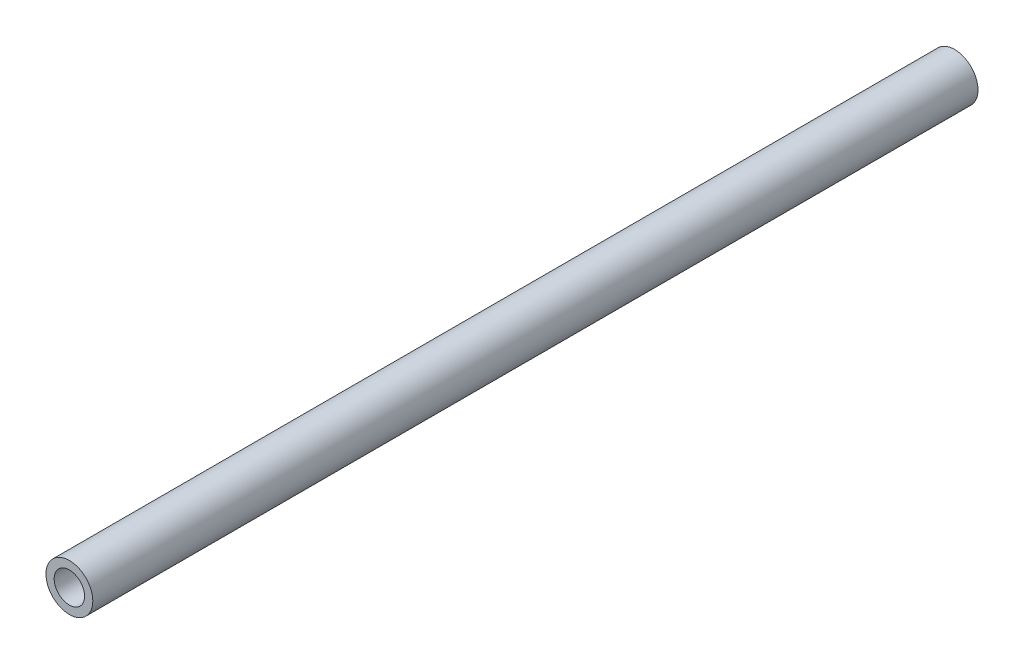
from build123d import *

# Parameters (mm, degrees)
SKETCH_1_R      = 5
SKETCH_1_R_2    = 3.25
EXTRUDE_1_DEPTH = 189


with BuildPart() as part:
    # Sketch 1 → Extrude 1 (new body)
    with BuildSketch(Plane.XY):
        Circle(SKETCH_1_R)
        Circle(SKETCH_1_R_2, mode=Mode.SUBTRACT)
    extrude(amount=EXTRUDE_1_DEPTH)


solid = part.part
